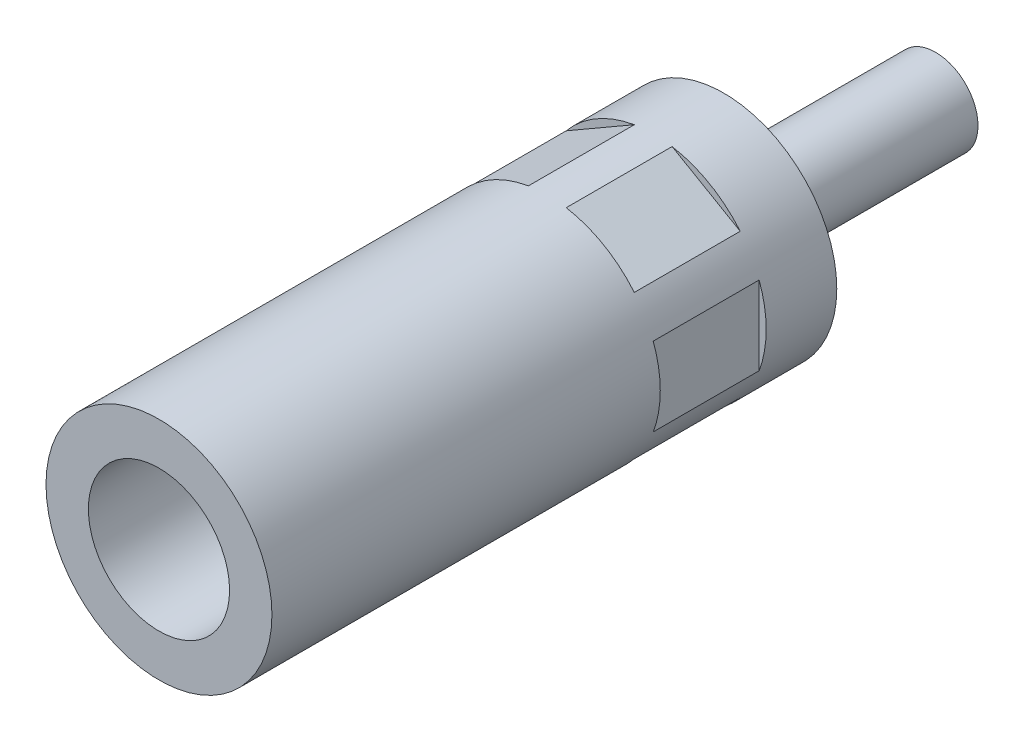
ISO-10303-21;
HEADER;
FILE_DESCRIPTION(('STEP AP214'),'2;1');
FILE_NAME('part.step','',(''),(''),'','','');
FILE_SCHEMA(('AUTOMOTIVE_DESIGN { 1 0 10303 214 1 1 1 1 }'));
ENDSEC;
DATA;
#1=APPLICATION_CONTEXT('core data for automotive mechanical design processes');
#2=APPLICATION_PROTOCOL_DEFINITION('international standard','automotive_design',2000,#1);
#3=PRODUCT_CONTEXT('',#1,'mechanical');
#4=PRODUCT('Part','Part','',(#3));
#5=PRODUCT_RELATED_PRODUCT_CATEGORY('part','',(#4));
#6=PRODUCT_DEFINITION_FORMATION('','',#4);
#7=PRODUCT_DEFINITION_CONTEXT('part definition',#1,'design');
#8=PRODUCT_DEFINITION('design','',#6,#7);
#9=PRODUCT_DEFINITION_SHAPE('','',#8);
#10=(LENGTH_UNIT() NAMED_UNIT(*) SI_UNIT(.MILLI.,.METRE.));
#11=(NAMED_UNIT(*) PLANE_ANGLE_UNIT() SI_UNIT($,.RADIAN.));
#12=(NAMED_UNIT(*) SI_UNIT($,.STERADIAN.) SOLID_ANGLE_UNIT());
#13=UNCERTAINTY_MEASURE_WITH_UNIT(LENGTH_MEASURE(1.E-05),#10,'distance_accuracy_value','');
#14=(GEOMETRIC_REPRESENTATION_CONTEXT(3) GLOBAL_UNCERTAINTY_ASSIGNED_CONTEXT((#13)) GLOBAL_UNIT_ASSIGNED_CONTEXT((#10,
#11,#12)) REPRESENTATION_CONTEXT('',''));
#15=CARTESIAN_POINT('',(0.,0.,0.));
#16=DIRECTION('',(0.,0.,1.));
#17=DIRECTION('',(1.,0.,0.));
#18=AXIS2_PLACEMENT_3D('',#15,#16,#17);
#19=CARTESIAN_POINT('',(0.,0.,80.));
#20=DIRECTION('',(0.,0.,1.));
#21=DIRECTION('',(1.,0.,0.));
#22=AXIS2_PLACEMENT_3D('',#19,#20,#21);
#23=CYLINDRICAL_SURFACE('',#22,16.);
#24=CARTESIAN_POINT('',(0.,0.,10.));
#25=DIRECTION('',(0.,0.,1.));
#26=DIRECTION('',(1.,0.,0.));
#27=AXIS2_PLACEMENT_3D('',#24,#25,#26);
#28=CIRCLE('',#27,16.);
#29=CARTESIAN_POINT('',(-12.3218253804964,-10.2064988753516,10.));
#30=VERTEX_POINT('',#29);
#31=CARTESIAN_POINT('',(-2.67817461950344,-15.7742632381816,10.));
#32=VERTEX_POINT('',#31);
#33=EDGE_CURVE('E153',#30,#32,#28,.T.);
#34=ORIENTED_EDGE('',*,*,#33,.F.);
#35=DIRECTION('',(0.,0.,1.));
#36=VECTOR('',#35,1.);
#37=CARTESIAN_POINT('',(-12.3218253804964,-10.2064988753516,80.));
#38=LINE('',#37,#36);
#39=CARTESIAN_POINT('',(-12.3218253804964,-10.2064988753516,25.));
#40=VERTEX_POINT('',#39);
#41=EDGE_CURVE('E9',#30,#40,#38,.T.);
#42=ORIENTED_EDGE('',*,*,#41,.T.);
#43=CARTESIAN_POINT('',(0.,0.,25.));
#44=DIRECTION('',(0.,0.,1.));
#45=DIRECTION('',(1.,0.,0.));
#46=AXIS2_PLACEMENT_3D('',#43,#44,#45);
#47=CIRCLE('',#46,16.);
#48=CARTESIAN_POINT('',(-2.67817461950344,-15.7742632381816,25.));
#49=VERTEX_POINT('',#48);
#50=EDGE_CURVE('E22',#40,#49,#47,.T.);
#51=ORIENTED_EDGE('',*,*,#50,.T.);
#52=DIRECTION('',(0.,0.,1.));
#53=VECTOR('',#52,1.);
#54=CARTESIAN_POINT('',(-2.67817461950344,-15.7742632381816,80.));
#55=LINE('',#54,#53);
#56=EDGE_CURVE('E150',#49,#32,#55,.F.);
#57=ORIENTED_EDGE('',*,*,#56,.T.);
#58=EDGE_LOOP('',(#34,#42,#51,#57));
#59=FACE_BOUND('',#58,.T.);
#60=DIRECTION('',(0.,0.,1.));
#61=VECTOR('',#60,1.);
#62=CARTESIAN_POINT('',(15.,5.56776436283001,80.));
#63=LINE('',#62,#61);
#64=CARTESIAN_POINT('',(15.,5.56776436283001,10.));
#65=VERTEX_POINT('',#64);
#66=CARTESIAN_POINT('',(15.,5.56776436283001,25.));
#67=VERTEX_POINT('',#66);
#68=EDGE_CURVE('E143',#65,#67,#63,.T.);
#69=ORIENTED_EDGE('',*,*,#68,.F.);
#70=CARTESIAN_POINT('',(15.,-5.56776436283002,10.));
#71=VERTEX_POINT('',#70);
#72=EDGE_CURVE('E142',#71,#65,#28,.T.);
#73=ORIENTED_EDGE('',*,*,#72,.F.);
#74=DIRECTION('',(0.,0.,1.));
#75=VECTOR('',#74,1.);
#76=CARTESIAN_POINT('',(15.,-5.56776436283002,80.));
#77=LINE('',#76,#75);
#78=CARTESIAN_POINT('',(15.,-5.56776436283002,25.));
#79=VERTEX_POINT('',#78);
#80=EDGE_CURVE('E139',#79,#71,#77,.F.);
#81=ORIENTED_EDGE('',*,*,#80,.F.);
#82=EDGE_CURVE('E146',#79,#67,#47,.T.);
#83=ORIENTED_EDGE('',*,*,#82,.T.);
#84=EDGE_LOOP('',(#69,#73,#81,#83));
#85=FACE_BOUND('',#84,.T.);
#86=CARTESIAN_POINT('',(12.3218253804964,10.2064988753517,10.));
#87=VERTEX_POINT('',#86);
#88=CARTESIAN_POINT('',(2.67817461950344,15.7742632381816,10.));
#89=VERTEX_POINT('',#88);
#90=EDGE_CURVE('E135',#87,#89,#28,.T.);
#91=ORIENTED_EDGE('',*,*,#90,.F.);
#92=DIRECTION('',(0.,0.,1.));
#93=VECTOR('',#92,1.);
#94=CARTESIAN_POINT('',(12.3218253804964,10.2064988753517,80.));
#95=LINE('',#94,#93);
#96=CARTESIAN_POINT('',(12.3218253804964,10.2064988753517,25.));
#97=VERTEX_POINT('',#96);
#98=EDGE_CURVE('E136',#87,#97,#95,.T.);
#99=ORIENTED_EDGE('',*,*,#98,.T.);
#100=CARTESIAN_POINT('',(2.67817461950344,15.7742632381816,25.));
#101=VERTEX_POINT('',#100);
#102=EDGE_CURVE('E140',#97,#101,#47,.T.);
#103=ORIENTED_EDGE('',*,*,#102,.T.);
#104=DIRECTION('',(0.,0.,1.));
#105=VECTOR('',#104,1.);
#106=CARTESIAN_POINT('',(2.67817461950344,15.7742632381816,80.));
#107=LINE('',#106,#105);
#108=EDGE_CURVE('E132',#101,#89,#107,.F.);
#109=ORIENTED_EDGE('',*,*,#108,.T.);
#110=EDGE_LOOP('',(#91,#99,#103,#109));
#111=FACE_BOUND('',#110,.T.);
#112=CARTESIAN_POINT('',(0.,0.,0.));
#113=DIRECTION('',(0.,0.,1.));
#114=DIRECTION('',(1.,0.,0.));
#115=AXIS2_PLACEMENT_3D('',#112,#113,#114);
#116=CIRCLE('',#115,16.);
#117=CARTESIAN_POINT('',(16.,0.,0.));
#118=VERTEX_POINT('',#117);
#119=EDGE_CURVE('E202',#118,#118,#116,.T.);
#120=ORIENTED_EDGE('',*,*,#119,.T.);
#121=EDGE_LOOP('',(#120));
#122=FACE_BOUND('',#121,.T.);
#123=CARTESIAN_POINT('',(0.,0.,80.));
#124=DIRECTION('',(0.,0.,1.));
#125=DIRECTION('',(1.,0.,0.));
#126=AXIS2_PLACEMENT_3D('',#123,#124,#125);
#127=CIRCLE('',#126,16.);
#128=CARTESIAN_POINT('',(16.,0.,80.));
#129=VERTEX_POINT('',#128);
#130=EDGE_CURVE('E205',#129,#129,#127,.T.);
#131=ORIENTED_EDGE('',*,*,#130,.F.);
#132=EDGE_LOOP('',(#131));
#133=FACE_BOUND('',#132,.T.);
#134=CARTESIAN_POINT('',(-15.,5.56776436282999,10.));
#135=VERTEX_POINT('',#134);
#136=CARTESIAN_POINT('',(-15.,-5.56776436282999,10.));
#137=VERTEX_POINT('',#136);
#138=EDGE_CURVE('E111',#135,#137,#28,.T.);
#139=ORIENTED_EDGE('',*,*,#138,.F.);
#140=DIRECTION('',(0.,0.,1.));
#141=VECTOR('',#140,1.);
#142=CARTESIAN_POINT('',(-15.,5.56776436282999,80.));
#143=LINE('',#142,#141);
#144=CARTESIAN_POINT('',(-15.,5.56776436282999,25.));
#145=VERTEX_POINT('',#144);
#146=EDGE_CURVE('E110',#135,#145,#143,.T.);
#147=ORIENTED_EDGE('',*,*,#146,.T.);
#148=CARTESIAN_POINT('',(-15.,-5.56776436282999,25.));
#149=VERTEX_POINT('',#148);
#150=EDGE_CURVE('E103',#145,#149,#47,.T.);
#151=ORIENTED_EDGE('',*,*,#150,.T.);
#152=DIRECTION('',(0.,0.,1.));
#153=VECTOR('',#152,1.);
#154=CARTESIAN_POINT('',(-15.,-5.56776436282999,80.));
#155=LINE('',#154,#153);
#156=EDGE_CURVE('E117',#149,#137,#155,.F.);
#157=ORIENTED_EDGE('',*,*,#156,.T.);
#158=EDGE_LOOP('',(#139,#147,#151,#157));
#159=FACE_BOUND('',#158,.T.);
#160=DIRECTION('',(0.,0.,1.));
#161=VECTOR('',#160,1.);
#162=CARTESIAN_POINT('',(-12.3218253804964,10.2064988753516,80.));
#163=LINE('',#162,#161);
#164=CARTESIAN_POINT('',(-12.3218253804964,10.2064988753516,10.));
#165=VERTEX_POINT('',#164);
#166=CARTESIAN_POINT('',(-12.3218253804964,10.2064988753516,25.));
#167=VERTEX_POINT('',#166);
#168=EDGE_CURVE('E130',#165,#167,#163,.T.);
#169=ORIENTED_EDGE('',*,*,#168,.F.);
#170=CARTESIAN_POINT('',(-2.67817461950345,15.7742632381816,10.));
#171=VERTEX_POINT('',#170);
#172=EDGE_CURVE('E126',#171,#165,#28,.T.);
#173=ORIENTED_EDGE('',*,*,#172,.F.);
#174=DIRECTION('',(0.,0.,1.));
#175=VECTOR('',#174,1.);
#176=CARTESIAN_POINT('',(-2.67817461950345,15.7742632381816,80.));
#177=LINE('',#176,#175);
#178=CARTESIAN_POINT('',(-2.67817461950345,15.7742632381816,25.));
#179=VERTEX_POINT('',#178);
#180=EDGE_CURVE('E124',#179,#171,#177,.F.);
#181=ORIENTED_EDGE('',*,*,#180,.F.);
#182=EDGE_CURVE('E113',#179,#167,#47,.T.);
#183=ORIENTED_EDGE('',*,*,#182,.T.);
#184=EDGE_LOOP('',(#169,#173,#181,#183));
#185=FACE_BOUND('',#184,.T.);
#186=DIRECTION('',(0.,0.,1.));
#187=VECTOR('',#186,1.);
#188=CARTESIAN_POINT('',(12.3218253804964,-10.2064988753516,80.));
#189=LINE('',#188,#187);
#190=CARTESIAN_POINT('',(12.3218253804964,-10.2064988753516,10.));
#191=VERTEX_POINT('',#190);
#192=CARTESIAN_POINT('',(12.3218253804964,-10.2064988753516,25.));
#193=VERTEX_POINT('',#192);
#194=EDGE_CURVE('E149',#191,#193,#189,.T.);
#195=ORIENTED_EDGE('',*,*,#194,.F.);
#196=CARTESIAN_POINT('',(2.67817461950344,-15.7742632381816,10.));
#197=VERTEX_POINT('',#196);
#198=EDGE_CURVE('E148',#197,#191,#28,.T.);
#199=ORIENTED_EDGE('',*,*,#198,.F.);
#200=DIRECTION('',(0.,0.,1.));
#201=VECTOR('',#200,1.);
#202=CARTESIAN_POINT('',(2.67817461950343,-15.7742632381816,80.));
#203=LINE('',#202,#201);
#204=CARTESIAN_POINT('',(2.67817461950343,-15.7742632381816,25.));
#205=VERTEX_POINT('',#204);
#206=EDGE_CURVE('E145',#205,#197,#203,.F.);
#207=ORIENTED_EDGE('',*,*,#206,.F.);
#208=EDGE_CURVE('E151',#205,#193,#47,.T.);
#209=ORIENTED_EDGE('',*,*,#208,.T.);
#210=EDGE_LOOP('',(#195,#199,#207,#209));
#211=FACE_BOUND('',#210,.T.);
#212=ADVANCED_FACE('F14',(#59,#85,#111,#122,#133,#159,#185,#211),#23,.T.);
#213=CARTESIAN_POINT('',(0.,0.,-30.));
#214=DIRECTION('',(0.,0.,1.));
#215=DIRECTION('',(1.,0.,0.));
#216=AXIS2_PLACEMENT_3D('',#213,#214,#215);
#217=PLANE('',#216);
#218=CARTESIAN_POINT('',(0.,0.,-30.));
#219=DIRECTION('',(0.,0.,1.));
#220=DIRECTION('',(1.,0.,0.));
#221=AXIS2_PLACEMENT_3D('',#218,#219,#220);
#222=CIRCLE('',#221,6.);
#223=CARTESIAN_POINT('',(6.,0.,-30.));
#224=VERTEX_POINT('',#223);
#225=EDGE_CURVE('E118',#224,#224,#222,.T.);
#226=ORIENTED_EDGE('',*,*,#225,.F.);
#227=EDGE_LOOP('',(#226));
#228=FACE_BOUND('',#227,.T.);
#229=ADVANCED_FACE('F16',(#228),#217,.F.);
#230=CARTESIAN_POINT('',(5.,0.,22.));
#231=DIRECTION('',(0.,0.,-1.));
#232=DIRECTION('',(-1.,0.,0.));
#233=AXIS2_PLACEMENT_3D('',#230,#231,#232);
#234=PLANE('',#233);
#235=CARTESIAN_POINT('',(0.,0.,22.));
#236=DIRECTION('',(0.,0.,1.));
#237=DIRECTION('',(1.,0.,0.));
#238=AXIS2_PLACEMENT_3D('',#235,#236,#237);
#239=CIRCLE('',#238,5.);
#240=CARTESIAN_POINT('',(5.,0.,22.));
#241=VERTEX_POINT('',#240);
#242=EDGE_CURVE('E160',#241,#241,#239,.T.);
#243=ORIENTED_EDGE('',*,*,#242,.T.);
#244=EDGE_LOOP('',(#243));
#245=FACE_BOUND('',#244,.T.);
#246=ADVANCED_FACE('F220',(#245),#234,.F.);
#247=CARTESIAN_POINT('',(0.,0.,80.));
#248=DIRECTION('',(0.,0.,1.));
#249=DIRECTION('',(1.,0.,0.));
#250=AXIS2_PLACEMENT_3D('',#247,#248,#249);
#251=CYLINDRICAL_SURFACE('',#250,5.);
#252=ORIENTED_EDGE('',*,*,#242,.F.);
#253=EDGE_LOOP('',(#252));
#254=FACE_BOUND('',#253,.T.);
#255=CARTESIAN_POINT('',(0.,0.,50.));
#256=DIRECTION('',(0.,0.,1.));
#257=DIRECTION('',(1.,0.,0.));
#258=AXIS2_PLACEMENT_3D('',#255,#256,#257);
#259=CIRCLE('',#258,5.);
#260=CARTESIAN_POINT('',(5.,0.,50.));
#261=VERTEX_POINT('',#260);
#262=EDGE_CURVE('E214',#261,#261,#259,.T.);
#263=ORIENTED_EDGE('',*,*,#262,.T.);
#264=EDGE_LOOP('',(#263));
#265=FACE_BOUND('',#264,.T.);
#266=ADVANCED_FACE('F222',(#254,#265),#251,.F.);
#267=CARTESIAN_POINT('',(5.,0.,50.));
#268=DIRECTION('',(0.,0.,1.));
#269=DIRECTION('',(1.,0.,0.));
#270=AXIS2_PLACEMENT_3D('',#267,#268,#269);
#271=PLANE('',#270);
#272=CARTESIAN_POINT('',(0.,0.,50.));
#273=DIRECTION('',(0.,0.,1.));
#274=DIRECTION('',(1.,0.,0.));
#275=AXIS2_PLACEMENT_3D('',#272,#273,#274);
#276=CIRCLE('',#275,10.);
#277=CARTESIAN_POINT('',(10.,0.,50.));
#278=VERTEX_POINT('',#277);
#279=EDGE_CURVE('E211',#278,#278,#276,.T.);
#280=ORIENTED_EDGE('',*,*,#279,.T.);
#281=EDGE_LOOP('',(#280));
#282=FACE_BOUND('',#281,.T.);
#283=ORIENTED_EDGE('',*,*,#262,.F.);
#284=EDGE_LOOP('',(#283));
#285=FACE_BOUND('',#284,.T.);
#286=ADVANCED_FACE('F225',(#282,#285),#271,.T.);
#287=CARTESIAN_POINT('',(0.,0.,80.));
#288=DIRECTION('',(0.,0.,1.));
#289=DIRECTION('',(1.,0.,0.));
#290=AXIS2_PLACEMENT_3D('',#287,#288,#289);
#291=CYLINDRICAL_SURFACE('',#290,10.);
#292=ORIENTED_EDGE('',*,*,#279,.F.);
#293=EDGE_LOOP('',(#292));
#294=FACE_BOUND('',#293,.T.);
#295=CARTESIAN_POINT('',(0.,0.,80.));
#296=DIRECTION('',(0.,0.,1.));
#297=DIRECTION('',(1.,0.,0.));
#298=AXIS2_PLACEMENT_3D('',#295,#296,#297);
#299=CIRCLE('',#298,10.);
#300=CARTESIAN_POINT('',(10.,0.,80.));
#301=VERTEX_POINT('',#300);
#302=EDGE_CURVE('E208',#301,#301,#299,.T.);
#303=ORIENTED_EDGE('',*,*,#302,.T.);
#304=EDGE_LOOP('',(#303));
#305=FACE_BOUND('',#304,.T.);
#306=ADVANCED_FACE('F230',(#294,#305),#291,.F.);
#307=CARTESIAN_POINT('',(16.,0.,80.));
#308=DIRECTION('',(0.,0.,-1.));
#309=DIRECTION('',(-1.,0.,0.));
#310=AXIS2_PLACEMENT_3D('',#307,#308,#309);
#311=PLANE('',#310);
#312=ORIENTED_EDGE('',*,*,#302,.F.);
#313=EDGE_LOOP('',(#312));
#314=FACE_BOUND('',#313,.T.);
#315=ORIENTED_EDGE('',*,*,#130,.T.);
#316=EDGE_LOOP('',(#315));
#317=FACE_BOUND('',#316,.T.);
#318=ADVANCED_FACE('F238',(#314,#317),#311,.F.);
#319=CARTESIAN_POINT('',(16.,0.,0.));
#320=DIRECTION('',(0.,0.,-1.));
#321=DIRECTION('',(-1.,0.,0.));
#322=AXIS2_PLACEMENT_3D('',#319,#320,#321);
#323=PLANE('',#322);
#324=CARTESIAN_POINT('',(0.,0.,0.));
#325=DIRECTION('',(0.,0.,1.));
#326=DIRECTION('',(1.,0.,0.));
#327=AXIS2_PLACEMENT_3D('',#324,#325,#326);
#328=CIRCLE('',#327,6.);
#329=CARTESIAN_POINT('',(6.,0.,0.));
#330=VERTEX_POINT('',#329);
#331=EDGE_CURVE('E199',#330,#330,#328,.T.);
#332=ORIENTED_EDGE('',*,*,#331,.T.);
#333=EDGE_LOOP('',(#332));
#334=FACE_BOUND('',#333,.T.);
#335=ORIENTED_EDGE('',*,*,#119,.F.);
#336=EDGE_LOOP('',(#335));
#337=FACE_BOUND('',#336,.T.);
#338=ADVANCED_FACE('F250',(#334,#337),#323,.T.);
#339=CARTESIAN_POINT('',(0.,0.,80.));
#340=DIRECTION('',(0.,0.,1.));
#341=DIRECTION('',(1.,0.,0.));
#342=AXIS2_PLACEMENT_3D('',#339,#340,#341);
#343=CYLINDRICAL_SURFACE('',#342,6.);
#344=ORIENTED_EDGE('',*,*,#331,.F.);
#345=EDGE_LOOP('',(#344));
#346=FACE_BOUND('',#345,.T.);
#347=ORIENTED_EDGE('',*,*,#225,.T.);
#348=EDGE_LOOP('',(#347));
#349=FACE_BOUND('',#348,.T.);
#350=ADVANCED_FACE('F258',(#346,#349),#343,.T.);
#351=CARTESIAN_POINT('',(-15.,8.66025403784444,25.));
#352=DIRECTION('',(1.,0.,0.));
#353=DIRECTION('',(0.,1.,0.));
#354=AXIS2_PLACEMENT_3D('',#351,#352,#353);
#355=PLANE('',#354);
#356=DIRECTION('',(0.,-1.,0.));
#357=VECTOR('',#356,1.);
#358=CARTESIAN_POINT('',(-15.,8.66025403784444,10.));
#359=LINE('',#358,#357);
#360=EDGE_CURVE('E193',#135,#137,#359,.T.);
#361=ORIENTED_EDGE('',*,*,#360,.T.);
#362=ORIENTED_EDGE('',*,*,#156,.F.);
#363=DIRECTION('',(0.,-1.,0.));
#364=VECTOR('',#363,1.);
#365=CARTESIAN_POINT('',(-15.,8.66025403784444,25.));
#366=LINE('',#365,#364);
#367=EDGE_CURVE('E106',#145,#149,#366,.T.);
#368=ORIENTED_EDGE('',*,*,#367,.F.);
#369=ORIENTED_EDGE('',*,*,#146,.F.);
#370=EDGE_LOOP('',(#361,#362,#368,#369));
#371=FACE_BOUND('',#370,.T.);
#372=ADVANCED_FACE('F115',(#371),#355,.F.);
#373=CARTESIAN_POINT('',(0.,0.,10.));
#374=DIRECTION('',(0.,0.,1.));
#375=DIRECTION('',(1.,0.,0.));
#376=AXIS2_PLACEMENT_3D('',#373,#374,#375);
#377=PLANE('',#376);
#378=ORIENTED_EDGE('',*,*,#138,.T.);
#379=ORIENTED_EDGE('',*,*,#360,.F.);
#380=EDGE_LOOP('',(#378,#379));
#381=FACE_BOUND('',#380,.T.);
#382=ADVANCED_FACE('F280',(#381),#377,.T.);
#383=CARTESIAN_POINT('',(0.,0.,25.));
#384=DIRECTION('',(0.,0.,1.));
#385=DIRECTION('',(1.,0.,0.));
#386=AXIS2_PLACEMENT_3D('',#383,#384,#385);
#387=PLANE('',#386);
#388=ORIENTED_EDGE('',*,*,#367,.T.);
#389=ORIENTED_EDGE('',*,*,#150,.F.);
#390=EDGE_LOOP('',(#388,#389));
#391=FACE_BOUND('',#390,.T.);
#392=ADVANCED_FACE('F105',(#391),#387,.F.);
#393=CARTESIAN_POINT('',(-15.,8.66025403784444,25.));
#394=DIRECTION('',(-0.5,0.866025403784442,0.));
#395=DIRECTION('',(-0.866025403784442,-0.5,0.));
#396=AXIS2_PLACEMENT_3D('',#393,#394,#395);
#397=PLANE('',#396);
#398=ORIENTED_EDGE('',*,*,#168,.T.);
#399=DIRECTION('',(0.866025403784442,0.5,0.));
#400=VECTOR('',#399,1.);
#401=CARTESIAN_POINT('',(-15.,8.66025403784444,25.));
#402=LINE('',#401,#400);
#403=EDGE_CURVE('E119',#167,#179,#402,.T.);
#404=ORIENTED_EDGE('',*,*,#403,.T.);
#405=ORIENTED_EDGE('',*,*,#180,.T.);
#406=DIRECTION('',(0.866025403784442,0.5,0.));
#407=VECTOR('',#406,1.);
#408=CARTESIAN_POINT('',(-15.,8.66025403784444,10.));
#409=LINE('',#408,#407);
#410=EDGE_CURVE('E344',#165,#171,#409,.T.);
#411=ORIENTED_EDGE('',*,*,#410,.F.);
#412=EDGE_LOOP('',(#398,#404,#405,#411));
#413=FACE_BOUND('',#412,.T.);
#414=ADVANCED_FACE('F306',(#413),#397,.T.);
#415=ORIENTED_EDGE('',*,*,#172,.T.);
#416=ORIENTED_EDGE('',*,*,#410,.T.);
#417=EDGE_LOOP('',(#415,#416));
#418=FACE_BOUND('',#417,.T.);
#419=ADVANCED_FACE('F294',(#418),#377,.T.);
#420=ORIENTED_EDGE('',*,*,#403,.F.);
#421=ORIENTED_EDGE('',*,*,#182,.F.);
#422=EDGE_LOOP('',(#420,#421));
#423=FACE_BOUND('',#422,.T.);
#424=ADVANCED_FACE('F289',(#423),#387,.F.);
#425=CARTESIAN_POINT('',(15.,8.66025403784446,25.));
#426=DIRECTION('',(-0.499999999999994,-0.866025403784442,0.));
#427=DIRECTION('',(0.866025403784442,-0.499999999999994,0.));
#428=AXIS2_PLACEMENT_3D('',#425,#426,#427);
#429=PLANE('',#428);
#430=DIRECTION('',(-0.866025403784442,0.499999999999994,0.));
#431=VECTOR('',#430,1.);
#432=CARTESIAN_POINT('',(15.,8.66025403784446,10.));
#433=LINE('',#432,#431);
#434=EDGE_CURVE('E345',#87,#89,#433,.T.);
#435=ORIENTED_EDGE('',*,*,#434,.T.);
#436=ORIENTED_EDGE('',*,*,#108,.F.);
#437=DIRECTION('',(-0.866025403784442,0.499999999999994,0.));
#438=VECTOR('',#437,1.);
#439=CARTESIAN_POINT('',(15.,8.66025403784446,25.));
#440=LINE('',#439,#438);
#441=EDGE_CURVE('E190',#97,#101,#440,.T.);
#442=ORIENTED_EDGE('',*,*,#441,.F.);
#443=ORIENTED_EDGE('',*,*,#98,.F.);
#444=EDGE_LOOP('',(#435,#436,#442,#443));
#445=FACE_BOUND('',#444,.T.);
#446=ADVANCED_FACE('F293',(#445),#429,.F.);
#447=ORIENTED_EDGE('',*,*,#90,.T.);
#448=ORIENTED_EDGE('',*,*,#434,.F.);
#449=EDGE_LOOP('',(#447,#448));
#450=FACE_BOUND('',#449,.T.);
#451=ADVANCED_FACE('F287',(#450),#377,.T.);
#452=ORIENTED_EDGE('',*,*,#441,.T.);
#453=ORIENTED_EDGE('',*,*,#102,.F.);
#454=EDGE_LOOP('',(#452,#453));
#455=FACE_BOUND('',#454,.T.);
#456=ADVANCED_FACE('F283',(#455),#387,.F.);
#457=CARTESIAN_POINT('',(15.,8.66025403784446,25.));
#458=DIRECTION('',(1.,0.,0.));
#459=DIRECTION('',(0.,1.,0.));
#460=AXIS2_PLACEMENT_3D('',#457,#458,#459);
#461=PLANE('',#460);
#462=ORIENTED_EDGE('',*,*,#68,.T.);
#463=DIRECTION('',(0.,-1.,0.));
#464=VECTOR('',#463,1.);
#465=CARTESIAN_POINT('',(15.,8.66025403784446,25.));
#466=LINE('',#465,#464);
#467=EDGE_CURVE('E187',#67,#79,#466,.T.);
#468=ORIENTED_EDGE('',*,*,#467,.T.);
#469=ORIENTED_EDGE('',*,*,#80,.T.);
#470=DIRECTION('',(0.,-1.,0.));
#471=VECTOR('',#470,1.);
#472=CARTESIAN_POINT('',(15.,8.66025403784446,10.));
#473=LINE('',#472,#471);
#474=EDGE_CURVE('E348',#65,#71,#473,.T.);
#475=ORIENTED_EDGE('',*,*,#474,.F.);
#476=EDGE_LOOP('',(#462,#468,#469,#475));
#477=FACE_BOUND('',#476,.T.);
#478=ADVANCED_FACE('F286',(#477),#461,.T.);
#479=ORIENTED_EDGE('',*,*,#72,.T.);
#480=ORIENTED_EDGE('',*,*,#474,.T.);
#481=EDGE_LOOP('',(#479,#480));
#482=FACE_BOUND('',#481,.T.);
#483=ADVANCED_FACE('F295',(#482),#377,.T.);
#484=ORIENTED_EDGE('',*,*,#467,.F.);
#485=ORIENTED_EDGE('',*,*,#82,.F.);
#486=EDGE_LOOP('',(#484,#485));
#487=FACE_BOUND('',#486,.T.);
#488=ADVANCED_FACE('F290',(#487),#387,.F.);
#489=CARTESIAN_POINT('',(15.,-8.66025403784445,25.));
#490=DIRECTION('',(0.5,-0.866025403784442,0.));
#491=DIRECTION('',(0.866025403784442,0.5,0.));
#492=AXIS2_PLACEMENT_3D('',#489,#490,#491);
#493=PLANE('',#492);
#494=ORIENTED_EDGE('',*,*,#194,.T.);
#495=DIRECTION('',(-0.866025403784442,-0.5,0.));
#496=VECTOR('',#495,1.);
#497=CARTESIAN_POINT('',(15.,-8.66025403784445,25.));
#498=LINE('',#497,#496);
#499=EDGE_CURVE('E37',#193,#205,#498,.T.);
#500=ORIENTED_EDGE('',*,*,#499,.T.);
#501=ORIENTED_EDGE('',*,*,#206,.T.);
#502=DIRECTION('',(-0.866025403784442,-0.5,0.));
#503=VECTOR('',#502,1.);
#504=CARTESIAN_POINT('',(15.,-8.66025403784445,10.));
#505=LINE('',#504,#503);
#506=EDGE_CURVE('E352',#191,#197,#505,.T.);
#507=ORIENTED_EDGE('',*,*,#506,.F.);
#508=EDGE_LOOP('',(#494,#500,#501,#507));
#509=FACE_BOUND('',#508,.T.);
#510=ADVANCED_FACE('F296',(#509),#493,.T.);
#511=ORIENTED_EDGE('',*,*,#198,.T.);
#512=ORIENTED_EDGE('',*,*,#506,.T.);
#513=EDGE_LOOP('',(#511,#512));
#514=FACE_BOUND('',#513,.T.);
#515=ADVANCED_FACE('F299',(#514),#377,.T.);
#516=ORIENTED_EDGE('',*,*,#499,.F.);
#517=ORIENTED_EDGE('',*,*,#208,.F.);
#518=EDGE_LOOP('',(#516,#517));
#519=FACE_BOUND('',#518,.T.);
#520=ADVANCED_FACE('F186',(#519),#387,.F.);
#521=DIRECTION('',(0.866025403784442,-0.5,0.));
#522=VECTOR('',#521,1.);
#523=CARTESIAN_POINT('',(-15.,-8.66025403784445,25.));
#524=LINE('',#523,#522);
#525=EDGE_CURVE('E188',#40,#49,#524,.T.);
#526=ORIENTED_EDGE('',*,*,#525,.T.);
#527=ORIENTED_EDGE('',*,*,#50,.F.);
#528=EDGE_LOOP('',(#526,#527));
#529=FACE_BOUND('',#528,.T.);
#530=ADVANCED_FACE('F317',(#529),#387,.F.);
#531=ORIENTED_EDGE('',*,*,#33,.T.);
#532=DIRECTION('',(0.866025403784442,-0.5,0.));
#533=VECTOR('',#532,1.);
#534=CARTESIAN_POINT('',(-15.,-8.66025403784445,10.));
#535=LINE('',#534,#533);
#536=EDGE_CURVE('E29',#30,#32,#535,.T.);
#537=ORIENTED_EDGE('',*,*,#536,.F.);
#538=EDGE_LOOP('',(#531,#537));
#539=FACE_BOUND('',#538,.T.);
#540=ADVANCED_FACE('F312',(#539),#377,.T.);
#541=CARTESIAN_POINT('',(-15.,-8.66025403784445,25.));
#542=DIRECTION('',(0.5,0.866025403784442,0.));
#543=DIRECTION('',(-0.866025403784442,0.5,0.));
#544=AXIS2_PLACEMENT_3D('',#541,#542,#543);
#545=PLANE('',#544);
#546=ORIENTED_EDGE('',*,*,#536,.T.);
#547=ORIENTED_EDGE('',*,*,#56,.F.);
#548=ORIENTED_EDGE('',*,*,#525,.F.);
#549=ORIENTED_EDGE('',*,*,#41,.F.);
#550=EDGE_LOOP('',(#546,#547,#548,#549));
#551=FACE_BOUND('',#550,.T.);
#552=ADVANCED_FACE('F310',(#551),#545,.F.);
#553=CLOSED_SHELL('',(#212,#229,#246,#266,#286,#306,#318,#338,#350,#372,#382,#392,#414,#419,
#424,#446,#451,#456,#478,#483,#488,#510,#515,#520,#530,#540,#552));
#554=MANIFOLD_SOLID_BREP('B1',#553);
#555=ADVANCED_BREP_SHAPE_REPRESENTATION('',(#18,#554),#14);
#556=SHAPE_DEFINITION_REPRESENTATION(#9,#555);
ENDSEC;
END-ISO-10303-21;
